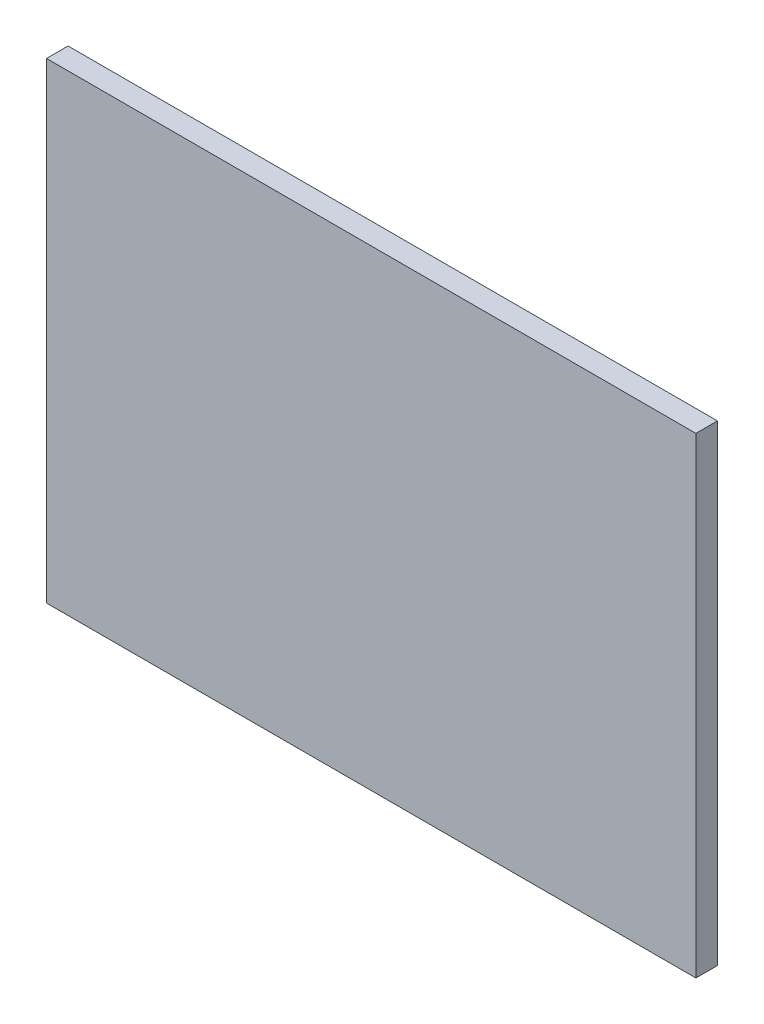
ISO-10303-21;
HEADER;
FILE_DESCRIPTION(('STEP AP214'),'2;1');
FILE_NAME('part.step','',(''),(''),'','','');
FILE_SCHEMA(('AUTOMOTIVE_DESIGN { 1 0 10303 214 1 1 1 1 }'));
ENDSEC;
DATA;
#1=APPLICATION_CONTEXT('core data for automotive mechanical design processes');
#2=APPLICATION_PROTOCOL_DEFINITION('international standard','automotive_design',2000,#1);
#3=PRODUCT_CONTEXT('',#1,'mechanical');
#4=PRODUCT('Part','Part','',(#3));
#5=PRODUCT_RELATED_PRODUCT_CATEGORY('part','',(#4));
#6=PRODUCT_DEFINITION_FORMATION('','',#4);
#7=PRODUCT_DEFINITION_CONTEXT('part definition',#1,'design');
#8=PRODUCT_DEFINITION('design','',#6,#7);
#9=PRODUCT_DEFINITION_SHAPE('','',#8);
#10=(LENGTH_UNIT() NAMED_UNIT(*) SI_UNIT(.MILLI.,.METRE.));
#11=(NAMED_UNIT(*) PLANE_ANGLE_UNIT() SI_UNIT($,.RADIAN.));
#12=(NAMED_UNIT(*) SI_UNIT($,.STERADIAN.) SOLID_ANGLE_UNIT());
#13=UNCERTAINTY_MEASURE_WITH_UNIT(LENGTH_MEASURE(1.E-05),#10,'distance_accuracy_value','');
#14=(GEOMETRIC_REPRESENTATION_CONTEXT(3) GLOBAL_UNCERTAINTY_ASSIGNED_CONTEXT((#13)) GLOBAL_UNIT_ASSIGNED_CONTEXT((#10,
#11,#12)) REPRESENTATION_CONTEXT('',''));
#15=CARTESIAN_POINT('',(0.,0.,0.));
#16=DIRECTION('',(0.,0.,1.));
#17=DIRECTION('',(1.,0.,0.));
#18=AXIS2_PLACEMENT_3D('',#15,#16,#17);
#19=CARTESIAN_POINT('',(153.5,111.5,5.1));
#20=DIRECTION('',(-1.,0.,0.));
#21=DIRECTION('',(0.,-1.,0.));
#22=AXIS2_PLACEMENT_3D('',#19,#20,#21);
#23=PLANE('',#22);
#24=DIRECTION('',(0.,1.,0.));
#25=VECTOR('',#24,1.);
#26=CARTESIAN_POINT('',(153.5,111.5,-5.1));
#27=LINE('',#26,#25);
#28=CARTESIAN_POINT('',(153.5,-111.5,-5.1));
#29=VERTEX_POINT('',#28);
#30=CARTESIAN_POINT('',(153.5,111.5,-5.1));
#31=VERTEX_POINT('',#30);
#32=EDGE_CURVE('E96',#29,#31,#27,.T.);
#33=ORIENTED_EDGE('',*,*,#32,.T.);
#34=DIRECTION('',(0.,0.,-1.));
#35=VECTOR('',#34,1.);
#36=CARTESIAN_POINT('',(153.5,111.5,5.1));
#37=LINE('',#36,#35);
#38=CARTESIAN_POINT('',(153.5,111.5,5.1));
#39=VERTEX_POINT('',#38);
#40=EDGE_CURVE('E11',#39,#31,#37,.T.);
#41=ORIENTED_EDGE('',*,*,#40,.F.);
#42=DIRECTION('',(0.,1.,0.));
#43=VECTOR('',#42,1.);
#44=CARTESIAN_POINT('',(153.5,111.5,5.1));
#45=LINE('',#44,#43);
#46=CARTESIAN_POINT('',(153.5,-111.5,5.1));
#47=VERTEX_POINT('',#46);
#48=EDGE_CURVE('E84',#47,#39,#45,.T.);
#49=ORIENTED_EDGE('',*,*,#48,.F.);
#50=DIRECTION('',(0.,0.,-1.));
#51=VECTOR('',#50,1.);
#52=CARTESIAN_POINT('',(153.5,-111.5,5.1));
#53=LINE('',#52,#51);
#54=EDGE_CURVE('E92',#47,#29,#53,.T.);
#55=ORIENTED_EDGE('',*,*,#54,.T.);
#56=EDGE_LOOP('',(#33,#41,#49,#55));
#57=FACE_BOUND('',#56,.T.);
#58=ADVANCED_FACE('F33',(#57),#23,.F.);
#59=CARTESIAN_POINT('',(-153.5,111.5,5.1));
#60=DIRECTION('',(0.,-1.,0.));
#61=DIRECTION('',(0.,0.,-1.));
#62=AXIS2_PLACEMENT_3D('',#59,#60,#61);
#63=PLANE('',#62);
#64=DIRECTION('',(-1.,0.,0.));
#65=VECTOR('',#64,1.);
#66=CARTESIAN_POINT('',(-153.5,111.5,-5.1));
#67=LINE('',#66,#65);
#68=CARTESIAN_POINT('',(-153.5,111.5,-5.1));
#69=VERTEX_POINT('',#68);
#70=EDGE_CURVE('E88',#31,#69,#67,.T.);
#71=ORIENTED_EDGE('',*,*,#70,.T.);
#72=DIRECTION('',(0.,0.,-1.));
#73=VECTOR('',#72,1.);
#74=CARTESIAN_POINT('',(-153.5,111.5,5.1));
#75=LINE('',#74,#73);
#76=CARTESIAN_POINT('',(-153.5,111.5,5.1));
#77=VERTEX_POINT('',#76);
#78=EDGE_CURVE('E41',#77,#69,#75,.T.);
#79=ORIENTED_EDGE('',*,*,#78,.F.);
#80=DIRECTION('',(-1.,0.,0.));
#81=VECTOR('',#80,1.);
#82=CARTESIAN_POINT('',(-153.5,111.5,5.1));
#83=LINE('',#82,#81);
#84=EDGE_CURVE('E79',#39,#77,#83,.T.);
#85=ORIENTED_EDGE('',*,*,#84,.F.);
#86=ORIENTED_EDGE('',*,*,#40,.T.);
#87=EDGE_LOOP('',(#71,#79,#85,#86));
#88=FACE_BOUND('',#87,.T.);
#89=ADVANCED_FACE('F87',(#88),#63,.F.);
#90=CARTESIAN_POINT('',(-153.5,111.5,5.1));
#91=DIRECTION('',(1.,0.,0.));
#92=DIRECTION('',(0.,0.,-1.));
#93=AXIS2_PLACEMENT_3D('',#90,#91,#92);
#94=PLANE('',#93);
#95=DIRECTION('',(0.,-1.,0.));
#96=VECTOR('',#95,1.);
#97=CARTESIAN_POINT('',(-153.5,111.5,-5.1));
#98=LINE('',#97,#96);
#99=CARTESIAN_POINT('',(-153.5,-111.5,-5.1));
#100=VERTEX_POINT('',#99);
#101=EDGE_CURVE('E66',#69,#100,#98,.T.);
#102=ORIENTED_EDGE('',*,*,#101,.T.);
#103=DIRECTION('',(0.,0.,-1.));
#104=VECTOR('',#103,1.);
#105=CARTESIAN_POINT('',(-153.5,-111.5,5.1));
#106=LINE('',#105,#104);
#107=CARTESIAN_POINT('',(-153.5,-111.5,5.1));
#108=VERTEX_POINT('',#107);
#109=EDGE_CURVE('E89',#108,#100,#106,.T.);
#110=ORIENTED_EDGE('',*,*,#109,.F.);
#111=DIRECTION('',(0.,-1.,0.));
#112=VECTOR('',#111,1.);
#113=CARTESIAN_POINT('',(-153.5,111.5,5.1));
#114=LINE('',#113,#112);
#115=EDGE_CURVE('E82',#77,#108,#114,.T.);
#116=ORIENTED_EDGE('',*,*,#115,.F.);
#117=ORIENTED_EDGE('',*,*,#78,.T.);
#118=EDGE_LOOP('',(#102,#110,#116,#117));
#119=FACE_BOUND('',#118,.T.);
#120=ADVANCED_FACE('F90',(#119),#94,.F.);
#121=CARTESIAN_POINT('',(-153.5,-111.5,5.1));
#122=DIRECTION('',(0.,1.,0.));
#123=DIRECTION('',(0.,0.,1.));
#124=AXIS2_PLACEMENT_3D('',#121,#122,#123);
#125=PLANE('',#124);
#126=DIRECTION('',(1.,0.,0.));
#127=VECTOR('',#126,1.);
#128=CARTESIAN_POINT('',(-153.5,-111.5,-5.1));
#129=LINE('',#128,#127);
#130=EDGE_CURVE('E72',#100,#29,#129,.T.);
#131=ORIENTED_EDGE('',*,*,#130,.T.);
#132=ORIENTED_EDGE('',*,*,#54,.F.);
#133=DIRECTION('',(1.,0.,0.));
#134=VECTOR('',#133,1.);
#135=CARTESIAN_POINT('',(-153.5,-111.5,5.1));
#136=LINE('',#135,#134);
#137=EDGE_CURVE('E49',#108,#47,#136,.T.);
#138=ORIENTED_EDGE('',*,*,#137,.F.);
#139=ORIENTED_EDGE('',*,*,#109,.T.);
#140=EDGE_LOOP('',(#131,#132,#138,#139));
#141=FACE_BOUND('',#140,.T.);
#142=ADVANCED_FACE('F103',(#141),#125,.F.);
#143=CARTESIAN_POINT('',(0.,0.,5.1));
#144=DIRECTION('',(0.,0.,1.));
#145=DIRECTION('',(1.,0.,0.));
#146=AXIS2_PLACEMENT_3D('',#143,#144,#145);
#147=PLANE('',#146);
#148=ORIENTED_EDGE('',*,*,#48,.T.);
#149=ORIENTED_EDGE('',*,*,#84,.T.);
#150=ORIENTED_EDGE('',*,*,#115,.T.);
#151=ORIENTED_EDGE('',*,*,#137,.T.);
#152=EDGE_LOOP('',(#148,#149,#150,#151));
#153=FACE_BOUND('',#152,.T.);
#154=ADVANCED_FACE('F80',(#153),#147,.T.);
#155=CARTESIAN_POINT('',(0.,0.,-5.1));
#156=DIRECTION('',(0.,0.,1.));
#157=DIRECTION('',(1.,0.,0.));
#158=AXIS2_PLACEMENT_3D('',#155,#156,#157);
#159=PLANE('',#158);
#160=ORIENTED_EDGE('',*,*,#32,.F.);
#161=ORIENTED_EDGE('',*,*,#130,.F.);
#162=ORIENTED_EDGE('',*,*,#101,.F.);
#163=ORIENTED_EDGE('',*,*,#70,.F.);
#164=EDGE_LOOP('',(#160,#161,#162,#163));
#165=FACE_BOUND('',#164,.T.);
#166=ADVANCED_FACE('F106',(#165),#159,.F.);
#167=CLOSED_SHELL('',(#58,#89,#120,#142,#154,#166));
#168=MANIFOLD_SOLID_BREP('B2',#167);
#169=ADVANCED_BREP_SHAPE_REPRESENTATION('',(#18,#168),#14);
#170=SHAPE_DEFINITION_REPRESENTATION(#9,#169);
ENDSEC;
END-ISO-10303-21;
